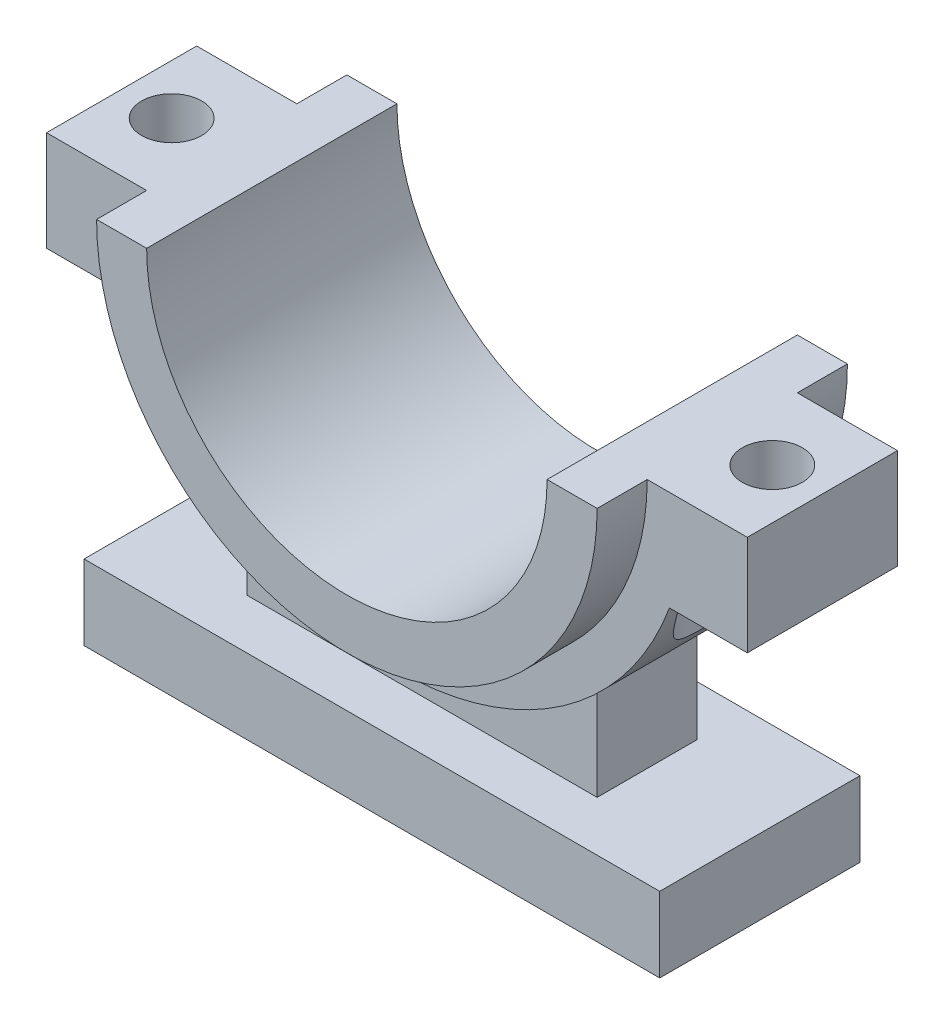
from build123d import *

# Parameters (mm, degrees)
DODANIE_WYCI_GNI_CIE1_DEPTH = 15
DODANIE_WYCI_GNI_CIE2_DEPTH = 25
SZKIC2_R                    = 6
WYTNIJ_WYCI_GNI_CIE1_DEPTH  = 84.480536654
SZKIC2_3_R                  = 14
WYTNIJ_WYCI_GNI_CIE2_DEPTH  = 84.480536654
DODANIE_WYCI_GNI_CIE3_DEPTH = 10
SZKIC1_5_W                  = 115
SZKIC1_5_H                  = 15
DODANIE_WYCI_GNI_CIE4_DEPTH = 20


with BuildPart() as part:
    # Szkic1 → Dodanie-wyci_gni_cie1 (new, symmetric)
    with BuildSketch(Plane.XY):
        with BuildLine():
            ThreePointArc((50, 0), (0, -50), (-50, 0))
            Line((-50, 0), (-70, 0))
            Line((-70, 0), (-70, -20))
            Line((-70, -20), (-54.442630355, -20))
            ThreePointArc((-54.442630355, -20), (-46.607432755, -34.521691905), (-35, -46.249324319))
            ThreePointArc((-35, -46.249324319), (0, -58), (35, -46.249324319))
            ThreePointArc((35, -46.249324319), (46.607432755, -34.521691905), (54.442630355, -20))
            Line((54.442630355, -20), (70, -20))
            Line((70, -20), (70, 0))
            Line((70, 0), (50, 0))
        make_face()
    extrude(amount=DODANIE_WYCI_GNI_CIE1_DEPTH, both=True)

    # Szkic1_3 → Dodanie-wyci_gni_cie2 (add, symmetric)
    with BuildSketch(Plane.XY):
        with BuildLine():
            ThreePointArc((40, 0), (0, -40), (-40, 0))
            Line((-40, 0), (-50, 0))
            ThreePointArc((-50, 0), (0, -50), (50, 0))
            Line((50, 0), (40, 0))
        make_face()
    extrude(amount=DODANIE_WYCI_GNI_CIE2_DEPTH, both=True)

    # Szkic2 → Wytnij-wyci_gni_cie1 (cut, through all)
    with BuildSketch(Plane.XZ.offset(20)):
        with Locations(Location((-60, 0, 0), (0, 0, 270))):
            Circle(SZKIC2_R)
        with Locations(Location((60, 0, 0), (0, 0, 270))):
            Circle(SZKIC2_R)
    extrude(amount=-WYTNIJ_WYCI_GNI_CIE1_DEPTH, mode=Mode.SUBTRACT)

    # Szkic2_3 → Wytnij-wyci_gni_cie2 (cut, through all)
    with BuildSketch(Plane.XZ.offset(20)):
        with Locations((-60, 0)):
            Circle(SZKIC2_3_R)
        with Locations((60, 0)):
            Circle(SZKIC2_3_R)
    extrude(amount=WYTNIJ_WYCI_GNI_CIE2_DEPTH, mode=Mode.SUBTRACT)

    # Szkic1_4 → Dodanie-wyci_gni_cie3 (add, symmetric)
    with BuildSketch(Plane.XY):
        with BuildLine():
            ThreePointArc((0, -58), (-18.459945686, -54.983910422), (-35, -46.249324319))
            Line((-35, -46.249324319), (-35, -65))
            Line((-35, -65), (0, -65))
            Line((0, -65), (0, -58))
        make_face()
        with BuildLine():
            ThreePointArc((35, -46.249324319), (18.459945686, -54.983910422), (0, -58))
            Line((0, -58), (0, -65))
            Line((0, -65), (35, -65))
            Line((35, -65), (35, -46.249324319))
        make_face()
    extrude(amount=DODANIE_WYCI_GNI_CIE3_DEPTH, both=True)

    # Szkic1_5 → Dodanie-wyci_gni_cie4 (add, symmetric)
    with BuildSketch(Plane.XY):
        with Locations((0, -72.5)):
            Rectangle(SZKIC1_5_W, SZKIC1_5_H)
    extrude(amount=DODANIE_WYCI_GNI_CIE4_DEPTH, both=True)


solid = part.part
